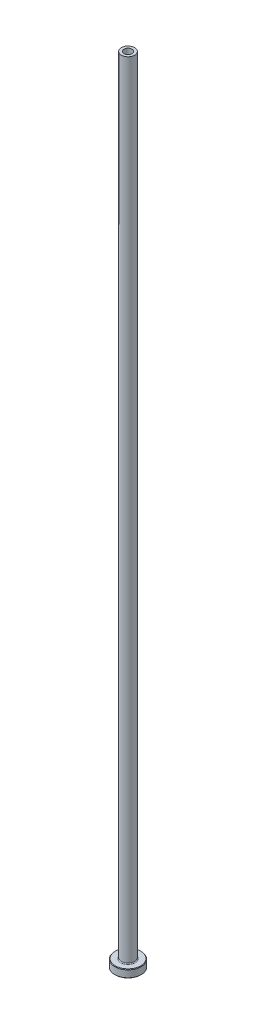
ISO-10303-21;
HEADER;
FILE_DESCRIPTION(('STEP AP214'),'2;1');
FILE_NAME('part.step','',(''),(''),'','','');
FILE_SCHEMA(('AUTOMOTIVE_DESIGN { 1 0 10303 214 1 1 1 1 }'));
ENDSEC;
DATA;
#1=APPLICATION_CONTEXT('core data for automotive mechanical design processes');
#2=APPLICATION_PROTOCOL_DEFINITION('international standard','automotive_design',2000,#1);
#3=PRODUCT_CONTEXT('',#1,'mechanical');
#4=PRODUCT('Part','Part','',(#3));
#5=PRODUCT_RELATED_PRODUCT_CATEGORY('part','',(#4));
#6=PRODUCT_DEFINITION_FORMATION('','',#4);
#7=PRODUCT_DEFINITION_CONTEXT('part definition',#1,'design');
#8=PRODUCT_DEFINITION('design','',#6,#7);
#9=PRODUCT_DEFINITION_SHAPE('','',#8);
#10=(LENGTH_UNIT() NAMED_UNIT(*) SI_UNIT(.MILLI.,.METRE.));
#11=(NAMED_UNIT(*) PLANE_ANGLE_UNIT() SI_UNIT($,.RADIAN.));
#12=(NAMED_UNIT(*) SI_UNIT($,.STERADIAN.) SOLID_ANGLE_UNIT());
#13=UNCERTAINTY_MEASURE_WITH_UNIT(LENGTH_MEASURE(1.E-05),#10,'distance_accuracy_value','');
#14=(GEOMETRIC_REPRESENTATION_CONTEXT(3) GLOBAL_UNCERTAINTY_ASSIGNED_CONTEXT((#13)) GLOBAL_UNIT_ASSIGNED_CONTEXT((#10,
#11,#12)) REPRESENTATION_CONTEXT('',''));
#15=CARTESIAN_POINT('',(0.,0.,0.));
#16=DIRECTION('',(0.,0.,1.));
#17=DIRECTION('',(1.,0.,0.));
#18=AXIS2_PLACEMENT_3D('',#15,#16,#17);
#19=CARTESIAN_POINT('',(0.,92.1876809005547,0.));
#20=DIRECTION('',(0.,1.,0.));
#21=DIRECTION('',(0.,0.,1.));
#22=AXIS2_PLACEMENT_3D('',#19,#20,#21);
#23=CYLINDRICAL_SURFACE('',#22,1.50000000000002);
#24=CARTESIAN_POINT('',(0.,300.,0.));
#25=DIRECTION('',(0.,1.,0.));
#26=DIRECTION('',(0.,0.,1.));
#27=AXIS2_PLACEMENT_3D('',#24,#25,#26);
#28=CIRCLE('',#27,1.50000000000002);
#29=CARTESIAN_POINT('',(0.,300.,1.50000000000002));
#30=VERTEX_POINT('',#29);
#31=EDGE_CURVE('E62',#30,#30,#28,.T.);
#32=ORIENTED_EDGE('',*,*,#31,.T.);
#33=EDGE_LOOP('',(#32));
#34=FACE_BOUND('',#33,.T.);
#35=CARTESIAN_POINT('',(0.,255.,0.));
#36=DIRECTION('',(0.,1.,0.));
#37=DIRECTION('',(0.,0.,1.));
#38=AXIS2_PLACEMENT_3D('',#35,#36,#37);
#39=CIRCLE('',#38,1.50000000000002);
#40=CARTESIAN_POINT('',(0.,255.,1.50000000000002));
#41=VERTEX_POINT('',#40);
#42=EDGE_CURVE('E71',#41,#41,#39,.T.);
#43=ORIENTED_EDGE('',*,*,#42,.F.);
#44=EDGE_LOOP('',(#43));
#45=FACE_BOUND('',#44,.T.);
#46=ADVANCED_FACE('F30',(#34,#45),#23,.F.);
#47=CARTESIAN_POINT('',(-1.50000000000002,300.,0.));
#48=DIRECTION('',(0.,1.,0.));
#49=DIRECTION('',(0.,0.,1.));
#50=AXIS2_PLACEMENT_3D('',#47,#48,#49);
#51=PLANE('',#50);
#52=CARTESIAN_POINT('',(0.,300.,0.));
#53=DIRECTION('',(0.,1.,0.));
#54=DIRECTION('',(0.,0.,1.));
#55=AXIS2_PLACEMENT_3D('',#52,#53,#54);
#56=CIRCLE('',#55,2.50000000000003);
#57=CARTESIAN_POINT('',(0.,300.,2.50000000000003));
#58=VERTEX_POINT('',#57);
#59=EDGE_CURVE('E65',#58,#58,#56,.T.);
#60=ORIENTED_EDGE('',*,*,#59,.T.);
#61=EDGE_LOOP('',(#60));
#62=FACE_BOUND('',#61,.T.);
#63=ORIENTED_EDGE('',*,*,#31,.F.);
#64=EDGE_LOOP('',(#63));
#65=FACE_BOUND('',#64,.T.);
#66=ADVANCED_FACE('F79',(#62,#65),#51,.T.);
#67=CARTESIAN_POINT('',(0.,92.1876809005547,0.));
#68=DIRECTION('',(0.,1.,0.));
#69=DIRECTION('',(0.,0.,1.));
#70=AXIS2_PLACEMENT_3D('',#67,#68,#69);
#71=CYLINDRICAL_SURFACE('',#70,2.50000000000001);
#72=CARTESIAN_POINT('',(0.,3.3,0.));
#73=DIRECTION('',(0.,1.,0.));
#74=DIRECTION('',(0.,0.,1.));
#75=AXIS2_PLACEMENT_3D('',#72,#73,#74);
#76=CIRCLE('',#75,2.50000000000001);
#77=CARTESIAN_POINT('',(0.,3.3,2.50000000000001));
#78=VERTEX_POINT('',#77);
#79=EDGE_CURVE('E59',#78,#78,#76,.T.);
#80=ORIENTED_EDGE('',*,*,#79,.T.);
#81=EDGE_LOOP('',(#80));
#82=FACE_BOUND('',#81,.T.);
#83=ORIENTED_EDGE('',*,*,#59,.F.);
#84=EDGE_LOOP('',(#83));
#85=FACE_BOUND('',#84,.T.);
#86=ADVANCED_FACE('F85',(#82,#85),#71,.T.);
#87=CARTESIAN_POINT('',(-2.49999999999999,3.,0.));
#88=DIRECTION('',(0.,1.,0.));
#89=DIRECTION('',(0.,0.,1.));
#90=AXIS2_PLACEMENT_3D('',#87,#88,#89);
#91=PLANE('',#90);
#92=CARTESIAN_POINT('',(0.,3.,0.));
#93=DIRECTION('',(0.,1.,0.));
#94=DIRECTION('',(0.,0.,1.));
#95=AXIS2_PLACEMENT_3D('',#92,#93,#94);
#96=CIRCLE('',#95,4.79999999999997);
#97=CARTESIAN_POINT('',(0.,3.,4.79999999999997));
#98=VERTEX_POINT('',#97);
#99=EDGE_CURVE('E53',#98,#98,#96,.T.);
#100=ORIENTED_EDGE('',*,*,#99,.T.);
#101=EDGE_LOOP('',(#100));
#102=FACE_BOUND('',#101,.T.);
#103=CARTESIAN_POINT('',(0.,3.,0.));
#104=DIRECTION('',(0.,1.,0.));
#105=DIRECTION('',(0.,0.,1.));
#106=AXIS2_PLACEMENT_3D('',#103,#104,#105);
#107=CIRCLE('',#106,2.80000000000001);
#108=CARTESIAN_POINT('',(0.,3.,2.80000000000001));
#109=VERTEX_POINT('',#108);
#110=EDGE_CURVE('E56',#109,#109,#107,.F.);
#111=ORIENTED_EDGE('',*,*,#110,.T.);
#112=EDGE_LOOP('',(#111));
#113=FACE_BOUND('',#112,.T.);
#114=ADVANCED_FACE('F111',(#102,#113),#91,.T.);
#115=CARTESIAN_POINT('',(0.,92.1876809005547,0.));
#116=DIRECTION('',(0.,1.,0.));
#117=DIRECTION('',(0.,0.,1.));
#118=AXIS2_PLACEMENT_3D('',#115,#116,#117);
#119=CYLINDRICAL_SURFACE('',#118,4.99999999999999);
#120=CARTESIAN_POINT('',(0.,2.79999999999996,0.));
#121=DIRECTION('',(0.,1.,0.));
#122=DIRECTION('',(0.,0.,1.));
#123=AXIS2_PLACEMENT_3D('',#120,#121,#122);
#124=CIRCLE('',#123,4.99999999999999);
#125=CARTESIAN_POINT('',(0.,2.79999999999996,4.99999999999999));
#126=VERTEX_POINT('',#125);
#127=EDGE_CURVE('E45',#126,#126,#124,.F.);
#128=ORIENTED_EDGE('',*,*,#127,.T.);
#129=EDGE_LOOP('',(#128));
#130=FACE_BOUND('',#129,.T.);
#131=CARTESIAN_POINT('',(0.,0.199999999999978,0.));
#132=DIRECTION('',(0.,-1.,0.));
#133=DIRECTION('',(0.,0.,-1.));
#134=AXIS2_PLACEMENT_3D('',#131,#132,#133);
#135=CIRCLE('',#134,4.99999999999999);
#136=CARTESIAN_POINT('',(0.,0.199999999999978,4.99999999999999));
#137=VERTEX_POINT('',#136);
#138=EDGE_CURVE('E50',#137,#137,#135,.F.);
#139=ORIENTED_EDGE('',*,*,#138,.T.);
#140=EDGE_LOOP('',(#139));
#141=FACE_BOUND('',#140,.T.);
#142=ADVANCED_FACE('F108',(#130,#141),#119,.T.);
#143=CARTESIAN_POINT('',(-4.99999999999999,0.,0.));
#144=DIRECTION('',(0.,-1.,0.));
#145=DIRECTION('',(0.,0.,-1.));
#146=AXIS2_PLACEMENT_3D('',#143,#144,#145);
#147=PLANE('',#146);
#148=CARTESIAN_POINT('',(0.,0.,0.));
#149=DIRECTION('',(0.,-1.,0.));
#150=DIRECTION('',(0.,0.,-1.));
#151=AXIS2_PLACEMENT_3D('',#148,#149,#150);
#152=CIRCLE('',#151,2.25);
#153=CARTESIAN_POINT('',(0.,0.,-2.25));
#154=VERTEX_POINT('',#153);
#155=EDGE_CURVE('E37',#154,#154,#152,.F.);
#156=ORIENTED_EDGE('',*,*,#155,.T.);
#157=EDGE_LOOP('',(#156));
#158=FACE_BOUND('',#157,.T.);
#159=CARTESIAN_POINT('',(0.,0.,0.));
#160=DIRECTION('',(0.,-1.,0.));
#161=DIRECTION('',(0.,0.,-1.));
#162=AXIS2_PLACEMENT_3D('',#159,#160,#161);
#163=CIRCLE('',#162,4.80000000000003);
#164=CARTESIAN_POINT('',(0.,0.,4.80000000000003));
#165=VERTEX_POINT('',#164);
#166=EDGE_CURVE('E41',#165,#165,#163,.T.);
#167=ORIENTED_EDGE('',*,*,#166,.T.);
#168=EDGE_LOOP('',(#167));
#169=FACE_BOUND('',#168,.T.);
#170=ADVANCED_FACE('F110',(#158,#169),#147,.T.);
#171=CARTESIAN_POINT('',(0.,92.1876809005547,0.));
#172=DIRECTION('',(0.,1.,0.));
#173=DIRECTION('',(0.,0.,1.));
#174=AXIS2_PLACEMENT_3D('',#171,#172,#173);
#175=CYLINDRICAL_SURFACE('',#174,1.75000000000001);
#176=CARTESIAN_POINT('',(0.,0.499999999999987,0.));
#177=DIRECTION('',(0.,-1.,0.));
#178=DIRECTION('',(0.,0.,-1.));
#179=AXIS2_PLACEMENT_3D('',#176,#177,#178);
#180=CIRCLE('',#179,1.75000000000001);
#181=CARTESIAN_POINT('',(0.,0.499999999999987,-1.75000000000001));
#182=VERTEX_POINT('',#181);
#183=EDGE_CURVE('E10',#182,#182,#180,.T.);
#184=ORIENTED_EDGE('',*,*,#183,.T.);
#185=EDGE_LOOP('',(#184));
#186=FACE_BOUND('',#185,.T.);
#187=CARTESIAN_POINT('',(0.,243.,0.));
#188=DIRECTION('',(0.,1.,0.));
#189=DIRECTION('',(0.,0.,1.));
#190=AXIS2_PLACEMENT_3D('',#187,#188,#189);
#191=CIRCLE('',#190,1.75000000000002);
#192=CARTESIAN_POINT('',(0.,243.,1.75000000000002));
#193=VERTEX_POINT('',#192);
#194=EDGE_CURVE('E68',#193,#193,#191,.T.);
#195=ORIENTED_EDGE('',*,*,#194,.T.);
#196=EDGE_LOOP('',(#195));
#197=FACE_BOUND('',#196,.T.);
#198=ADVANCED_FACE('F118',(#186,#197),#175,.F.);
#199=CARTESIAN_POINT('',(0.,243.,0.));
#200=DIRECTION('',(0.,-1.,0.));
#201=DIRECTION('',(0.,0.,-1.));
#202=AXIS2_PLACEMENT_3D('',#199,#200,#201);
#203=CONICAL_SURFACE('',#202,1.75000000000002,0.0208303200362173);
#204=ORIENTED_EDGE('',*,*,#42,.T.);
#205=EDGE_LOOP('',(#204));
#206=FACE_BOUND('',#205,.T.);
#207=ORIENTED_EDGE('',*,*,#194,.F.);
#208=EDGE_LOOP('',(#207));
#209=FACE_BOUND('',#208,.T.);
#210=ADVANCED_FACE('F75',(#206,#209),#203,.F.);
#211=CARTESIAN_POINT('',(0.,3.3,0.));
#212=DIRECTION('',(0.,1.,0.));
#213=DIRECTION('',(0.,0.,1.));
#214=AXIS2_PLACEMENT_3D('',#211,#212,#213);
#215=TOROIDAL_SURFACE('',#214,2.80000000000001,0.3);
#216=ORIENTED_EDGE('',*,*,#110,.F.);
#217=EDGE_LOOP('',(#216));
#218=FACE_BOUND('',#217,.T.);
#219=ORIENTED_EDGE('',*,*,#79,.F.);
#220=EDGE_LOOP('',(#219));
#221=FACE_BOUND('',#220,.T.);
#222=ADVANCED_FACE('F90',(#218,#221),#215,.F.);
#223=CARTESIAN_POINT('',(0.,3.,0.));
#224=DIRECTION('',(0.,-1.,0.));
#225=DIRECTION('',(0.,0.,-1.));
#226=AXIS2_PLACEMENT_3D('',#223,#224,#225);
#227=CONICAL_SURFACE('',#226,4.79999999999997,0.785398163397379);
#228=ORIENTED_EDGE('',*,*,#127,.F.);
#229=EDGE_LOOP('',(#228));
#230=FACE_BOUND('',#229,.T.);
#231=ORIENTED_EDGE('',*,*,#99,.F.);
#232=EDGE_LOOP('',(#231));
#233=FACE_BOUND('',#232,.T.);
#234=ADVANCED_FACE('F93',(#230,#233),#227,.T.);
#235=CARTESIAN_POINT('',(0.,0.199999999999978,0.));
#236=DIRECTION('',(0.,1.,0.));
#237=DIRECTION('',(0.,0.,1.));
#238=AXIS2_PLACEMENT_3D('',#235,#236,#237);
#239=CONICAL_SURFACE('',#238,4.99999999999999,0.785398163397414);
#240=CARTESIAN_POINT('',(0.,0.,4.80000000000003));
#241=CARTESIAN_POINT('',(0.,0.00208333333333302,4.80208333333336));
#242=CARTESIAN_POINT('',(0.,0.00416666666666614,4.80416666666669));
#243=CARTESIAN_POINT('',(0.,0.00833333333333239,4.80833333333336));
#244=CARTESIAN_POINT('',(0.,0.0104166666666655,4.81041666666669));
#245=CARTESIAN_POINT('',(0.,0.0145833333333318,4.81458333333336));
#246=CARTESIAN_POINT('',(0.,0.0166666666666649,4.81666666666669));
#247=CARTESIAN_POINT('',(0.,0.0208333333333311,4.82083333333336));
#248=CARTESIAN_POINT('',(0.,0.0229166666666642,4.82291666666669));
#249=CARTESIAN_POINT('',(0.,0.0270833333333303,4.82708333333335));
#250=CARTESIAN_POINT('',(0.,0.0291666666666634,4.82916666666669));
#251=CARTESIAN_POINT('',(0.,0.0333333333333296,4.83333333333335));
#252=CARTESIAN_POINT('',(0.,0.0354166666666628,4.83541666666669));
#253=CARTESIAN_POINT('',(0.,0.039583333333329,4.83958333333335));
#254=CARTESIAN_POINT('',(0.,0.0416666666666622,4.84166666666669));
#255=CARTESIAN_POINT('',(0.,0.0458333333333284,4.84583333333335));
#256=CARTESIAN_POINT('',(0.,0.0479166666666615,4.84791666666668));
#257=CARTESIAN_POINT('',(0.,0.0520833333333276,4.85208333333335));
#258=CARTESIAN_POINT('',(0.,0.0541666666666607,4.85416666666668));
#259=CARTESIAN_POINT('',(0.,0.0583333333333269,4.85833333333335));
#260=CARTESIAN_POINT('',(0.,0.06041666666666,4.86041666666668));
#261=CARTESIAN_POINT('',(0.,0.0645833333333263,4.86458333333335));
#262=CARTESIAN_POINT('',(0.,0.0666666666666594,4.86666666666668));
#263=CARTESIAN_POINT('',(0.,0.0708333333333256,4.87083333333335));
#264=CARTESIAN_POINT('',(0.,0.0729166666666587,4.87291666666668));
#265=CARTESIAN_POINT('',(0.,0.0770833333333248,4.87708333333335));
#266=CARTESIAN_POINT('',(0.,0.0791666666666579,4.87916666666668));
#267=CARTESIAN_POINT('',(0.,0.0833333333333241,4.88333333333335));
#268=CARTESIAN_POINT('',(0.,0.0854166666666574,4.88541666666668));
#269=CARTESIAN_POINT('',(0.,0.0895833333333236,4.88958333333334));
#270=CARTESIAN_POINT('',(0.,0.0916666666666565,4.89166666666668));
#271=CARTESIAN_POINT('',(0.,0.0958333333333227,4.89583333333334));
#272=CARTESIAN_POINT('',(0.,0.097916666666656,4.89791666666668));
#273=CARTESIAN_POINT('',(0.,0.102083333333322,4.90208333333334));
#274=CARTESIAN_POINT('',(0.,0.104166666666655,4.90416666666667));
#275=CARTESIAN_POINT('',(0.,0.108333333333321,4.90833333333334));
#276=CARTESIAN_POINT('',(0.,0.110416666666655,4.91041666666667));
#277=CARTESIAN_POINT('',(0.,0.114583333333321,4.91458333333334));
#278=CARTESIAN_POINT('',(0.,0.116666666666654,4.91666666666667));
#279=CARTESIAN_POINT('',(0.,0.12083333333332,4.92083333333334));
#280=CARTESIAN_POINT('',(0.,0.122916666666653,4.92291666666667));
#281=CARTESIAN_POINT('',(0.,0.127083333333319,4.92708333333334));
#282=CARTESIAN_POINT('',(0.,0.129166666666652,4.92916666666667));
#283=CARTESIAN_POINT('',(0.,0.133333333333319,4.93333333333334));
#284=CARTESIAN_POINT('',(0.,0.135416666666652,4.93541666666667));
#285=CARTESIAN_POINT('',(0.,0.139583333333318,4.93958333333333));
#286=CARTESIAN_POINT('',(0.,0.141666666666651,4.94166666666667));
#287=CARTESIAN_POINT('',(0.,0.145833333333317,4.94583333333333));
#288=CARTESIAN_POINT('',(0.,0.14791666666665,4.94791666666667));
#289=CARTESIAN_POINT('',(0.,0.152083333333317,4.95208333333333));
#290=CARTESIAN_POINT('',(0.,0.15416666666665,4.95416666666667));
#291=CARTESIAN_POINT('',(0.,0.158333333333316,4.95833333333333));
#292=CARTESIAN_POINT('',(0.,0.160416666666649,4.96041666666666));
#293=CARTESIAN_POINT('',(0.,0.164583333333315,4.96458333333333));
#294=CARTESIAN_POINT('',(0.,0.166666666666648,4.96666666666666));
#295=CARTESIAN_POINT('',(0.,0.170833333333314,4.97083333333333));
#296=CARTESIAN_POINT('',(0.,0.172916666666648,4.97291666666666));
#297=CARTESIAN_POINT('',(0.,0.177083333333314,4.97708333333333));
#298=CARTESIAN_POINT('',(0.,0.179166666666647,4.97916666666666));
#299=CARTESIAN_POINT('',(0.,0.183333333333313,4.98333333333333));
#300=CARTESIAN_POINT('',(0.,0.185416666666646,4.98541666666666));
#301=CARTESIAN_POINT('',(0.,0.189583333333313,4.98958333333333));
#302=CARTESIAN_POINT('',(0.,0.191666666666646,4.99166666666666));
#303=CARTESIAN_POINT('',(0.,0.195833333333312,4.99583333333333));
#304=CARTESIAN_POINT('',(0.,0.197916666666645,4.99791666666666));
#305=CARTESIAN_POINT('',(0.,0.199999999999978,4.99999999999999));
#306=B_SPLINE_CURVE_WITH_KNOTS('',3,(#240,#241,#242,#243,#244,#245,#246,#247,#248,#249,#250,
#251,#252,#253,#254,#255,#256,#257,#258,#259,#260,#261,#262,#263,#264,#265,#266,#267,#268,#269,
#270,#271,#272,#273,#274,#275,#276,#277,#278,#279,#280,#281,#282,#283,#284,#285,#286,#287,#288,
#289,#290,#291,#292,#293,#294,#295,#296,#297,#298,#299,#300,#301,#302,#303,#304,#305),
.UNSPECIFIED.,.F.,.F.,(4,2,2,2,2,2,2,2,2,2,2,2,2,2,2,2,2,2,2,2,2,2,2,2,2,2,2,2,2,2,2,2,4),(0.,
0.00883883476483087,0.0176776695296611,0.0265165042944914,0.0353553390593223,0.0441941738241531,
0.0530330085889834,0.0618718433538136,0.0707106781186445,0.0795495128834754,0.0883883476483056,
0.0972271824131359,0.106066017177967,0.114904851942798,0.123743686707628,0.132582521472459,
0.141421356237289,0.15026019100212,0.15909902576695,0.167937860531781,0.176776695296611,
0.185615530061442,0.194454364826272,0.203293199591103,0.212132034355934,0.220970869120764,
0.229809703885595,0.238648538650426,0.247487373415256,0.256326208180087,0.265165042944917,
0.274003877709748,0.282842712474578),.UNSPECIFIED.);
#307=EDGE_CURVE('BSEAM96',#165,#137,#306,.T.);
#308=ORIENTED_EDGE('',*,*,#166,.F.);
#309=ORIENTED_EDGE('',*,*,#138,.F.);
#310=ORIENTED_EDGE('',*,*,#307,.T.);
#311=ORIENTED_EDGE('',*,*,#307,.F.);
#312=EDGE_LOOP('',(#308,#310,#309,#311));
#313=FACE_BOUND('',#312,.T.);
#314=ADVANCED_FACE('F96',(#313),#239,.T.);
#315=CARTESIAN_POINT('',(0.,0.,0.));
#316=DIRECTION('',(0.,-1.,0.));
#317=DIRECTION('',(0.,0.,-1.));
#318=AXIS2_PLACEMENT_3D('',#315,#316,#317);
#319=CONICAL_SURFACE('',#318,2.25,0.785398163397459);
#320=ORIENTED_EDGE('',*,*,#183,.F.);
#321=EDGE_LOOP('',(#320));
#322=FACE_BOUND('',#321,.T.);
#323=ORIENTED_EDGE('',*,*,#155,.F.);
#324=EDGE_LOOP('',(#323));
#325=FACE_BOUND('',#324,.T.);
#326=ADVANCED_FACE('F32',(#322,#325),#319,.F.);
#327=CLOSED_SHELL('',(#46,#66,#86,#114,#142,#170,#198,#210,#222,#234,#314,#326));
#328=MANIFOLD_SOLID_BREP('B2',#327);
#329=ADVANCED_BREP_SHAPE_REPRESENTATION('',(#18,#328),#14);
#330=SHAPE_DEFINITION_REPRESENTATION(#9,#329);
ENDSEC;
END-ISO-10303-21;
